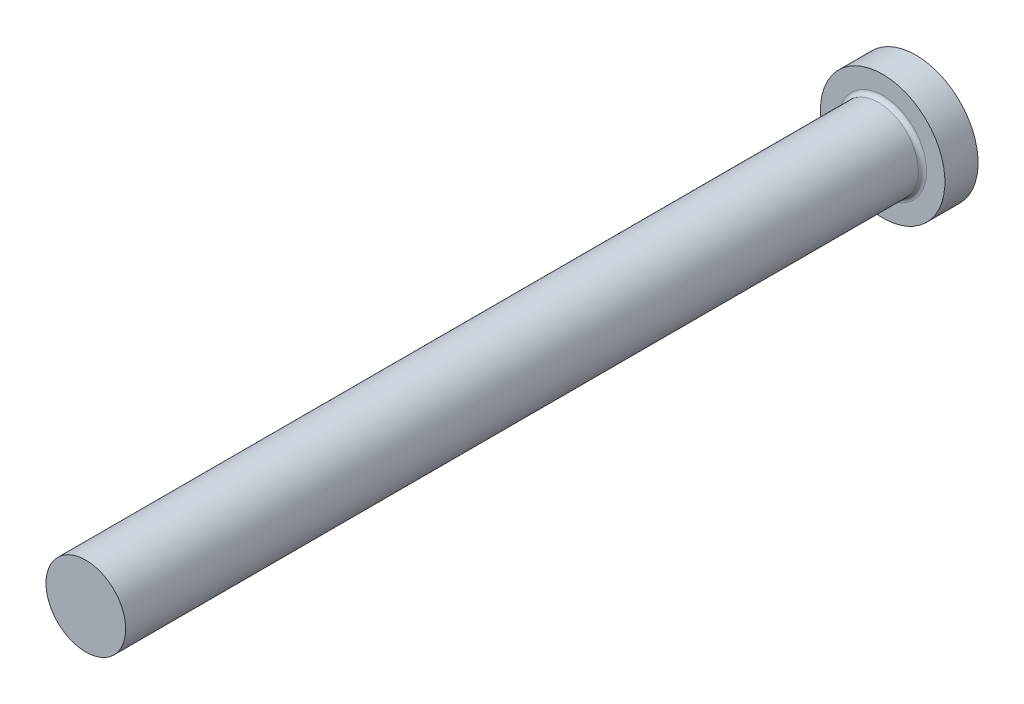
from build123d import *

# Parameters (mm, degrees)
FILLET1_R = 0.5


with BuildPart() as part:
    # FV → Revolve1 (revolve)
    with BuildSketch(Plane(origin=(0, 0, 0), x_dir=(1, 0, 0), z_dir=(0, 1, 0)), mode=Mode.PRIVATE) as revolve1_sk:
        Polygon((0, 0), (7.5, 0), (7.5, -4), (4.8, -4), (4.8, -100), (0, -100), align=None)
    revolve(revolve1_sk.sketch.rotate(Axis((0, 0, -9.033228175), (0, 0, 1)), 180), axis=Axis((0, 0, -9.033228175), (0, 0, 1)))

    # Fillet1
    fillet1_edges = [part.edges().sort_by_distance(p)[0] for p in [
        (4.8, 0, 4),
    ]]
    fillet(fillet1_edges, radius=FILLET1_R)


solid = part.part
